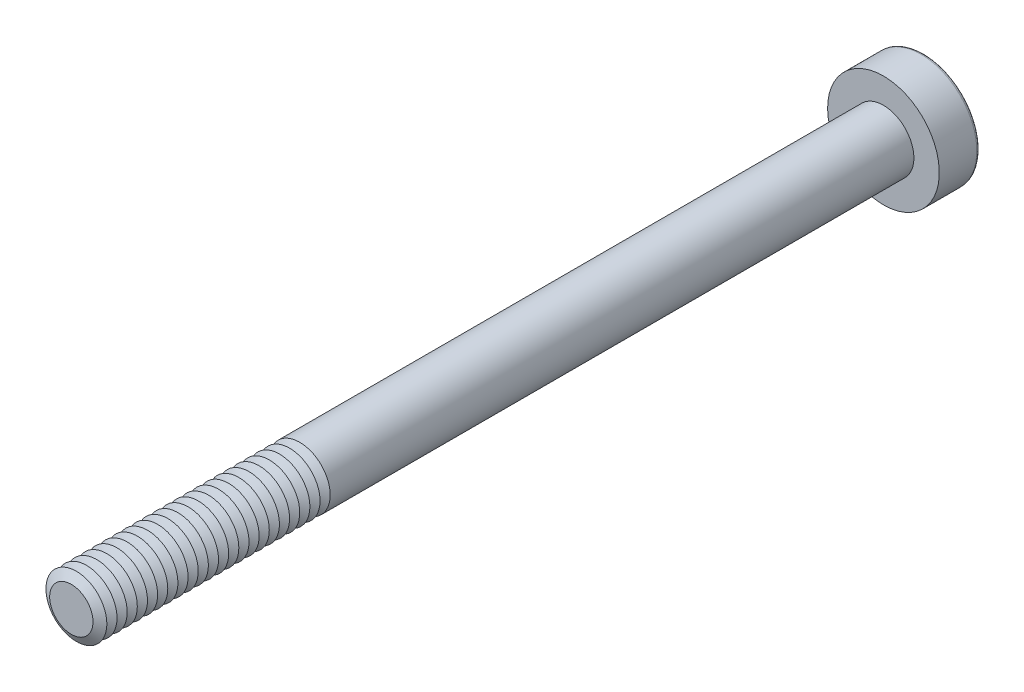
from build123d import *

# Parameters (mm, degrees)
SKETCH1_R           = 1.5
BOSS_EXTRUDE1_DEPTH = 40
SKETCH2_R           = 2.75
BOSS_EXTRUDE2_DEPTH = 2
CUT_EXTRUDE1_DEPTH  = 1.5
FILLET1_R           = 0.15
LPATTERN1_COUNT     = 23
LPATTERN1_PITCH     = 0.5


with BuildPart() as part:
    # Sketch1 → Boss-Extrude1 (new body)
    with BuildSketch(Plane.XY):
        Circle(SKETCH1_R)
    extrude(amount=BOSS_EXTRUDE1_DEPTH)

    # Sketch2 → Boss-Extrude2 (add)
    with BuildSketch(Plane(origin=(0, 0, 0), x_dir=(-1, 0, 0), z_dir=(0, 0, -1))):
        Circle(SKETCH2_R)
    extrude(amount=BOSS_EXTRUDE2_DEPTH)

    # Sketch3 → Cut-Extrude1 (cut)
    with BuildSketch(Plane(origin=(0, 0, -2), x_dir=(-1, 0, 0), z_dir=(0, 0, -1))):
        Polygon((-0.577350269, 1), (-1.154700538, 0), (-0.577350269, -1), (0.577350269, -1), (1.154700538, 0), (0.577350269, 1), align=None)
    extrude(amount=-CUT_EXTRUDE1_DEPTH, mode=Mode.SUBTRACT)

    # Fillet1
    fillet1_edges = [part.edges().sort_by_distance(p)[0] for p in [
        (2.75, 0, -2),
    ]]
    fillet(fillet1_edges, radius=FILLET1_R)

    # Cut-Extrude2 cone 1 section (on through the dimple's axis) → Cut-Extrude2 (revolve, cut)
    with BuildSketch(Plane(origin=(0, 0, -0.5), x_dir=(0, 1, 0), z_dir=(1, 0, 0))):
        Polygon((0, 0), (1, 0), (0, 0.577350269), align=None)
    revolve(axis=Axis((0, 0, -0.5), (0, 0, 1)), mode=Mode.SUBTRACT)

    # Cut-Extrude3 cone 1 section (on through the dimple's axis) → Cut-Extrude3 (revolve, cut)
    with BuildSketch(Plane(origin=(0, 0, -2), x_dir=(0, 1, 0), z_dir=(1, 0, 0))):
        Polygon((0, 0), (1.154700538, 0), (0, 0.309401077), align=None)
    revolve(axis=Axis((0, 0, -2), (0, 0, 1)), mode=Mode.SUBTRACT)

    # Sketch7 → Cut-Revolve1 (revolve, cut)
    with BuildSketch(Plane(origin=(0, 0, 0), x_dir=(0, 0, -1), z_dir=(1, 0, 0)), mode=Mode.PRIVATE) as cut_revolve1_sk:
        Polygon((-40, 1.066987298), (-39.75, 1.5), (-40.25, 1.5), align=None)
    cut_revolve1 = revolve(cut_revolve1_sk.sketch.rotate(Axis((0, 0, 40), (0, 0, -1)), 90), axis=Axis((0, 0, 40), (0, 0, -1)), mode=Mode.SUBTRACT)

    # LPattern1: Cut-Revolve1 ×23
    with Locations(*[(0, 0, -i * LPATTERN1_PITCH) for i in range(1, LPATTERN1_COUNT)]):
        add(cut_revolve1, mode=Mode.SUBTRACT)


solid = part.part
